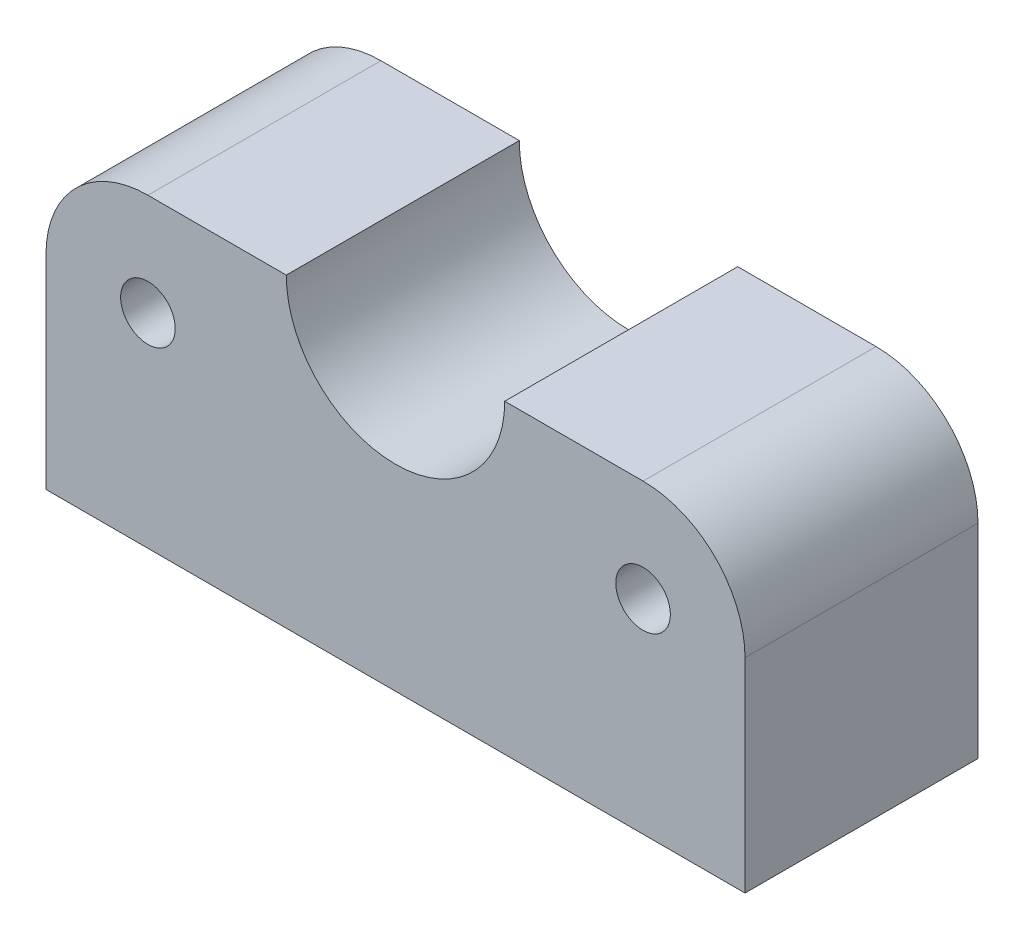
from build123d import *

# Parameters (mm, degrees)
BASE_EXTRUDE_DEPTH          = 33.866666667
F_3_8_16_TAPPED_HOLE1_D     = 7.9375
F_3_8_16_TAPPED_HOLE1_DEPTH = 23.8125
F_3_8_16_TAPPED_HOLE1_TIP   = 2.384665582


with BuildPart() as part:
    # Sketch3 → Base-Extrude (new body)
    with BuildSketch(Plane.XY):
        with BuildLine():
            Line((-101.6, 29.633333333), (-101.6, 0))
            Line((-101.6, 0), (0, 0))
            Line((0, 0), (0, 29.633333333))
            ThreePointArc((0, 29.633333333), (-4.339701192, 40.110298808), (-14.816666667, 44.45))
            Line((-14.816666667, 44.45), (-34.925, 44.45))
            ThreePointArc((-34.925, 44.45), (-50.8, 28.575), (-66.675, 44.45))
            Line((-66.675, 44.45), (-86.783333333, 44.45))
            ThreePointArc((-86.783333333, 44.45), (-97.260298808, 40.110298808), (-101.6, 29.633333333))
        make_face()
    extrude(amount=-BASE_EXTRUDE_DEPTH)

    # 3_8-16 Tapped Hole1
    with Locations(Plane.XY):
        with Locations((-86.783333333, 29.633333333), (-14.816666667, 29.633333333)):
            Hole(F_3_8_16_TAPPED_HOLE1_D / 2, depth=F_3_8_16_TAPPED_HOLE1_DEPTH)
            with Locations((0, 0, -(F_3_8_16_TAPPED_HOLE1_DEPTH + F_3_8_16_TAPPED_HOLE1_TIP / 2))):  # 118° drill point
                Cone(0, F_3_8_16_TAPPED_HOLE1_D / 2, F_3_8_16_TAPPED_HOLE1_TIP, mode=Mode.SUBTRACT)


solid = part.part
